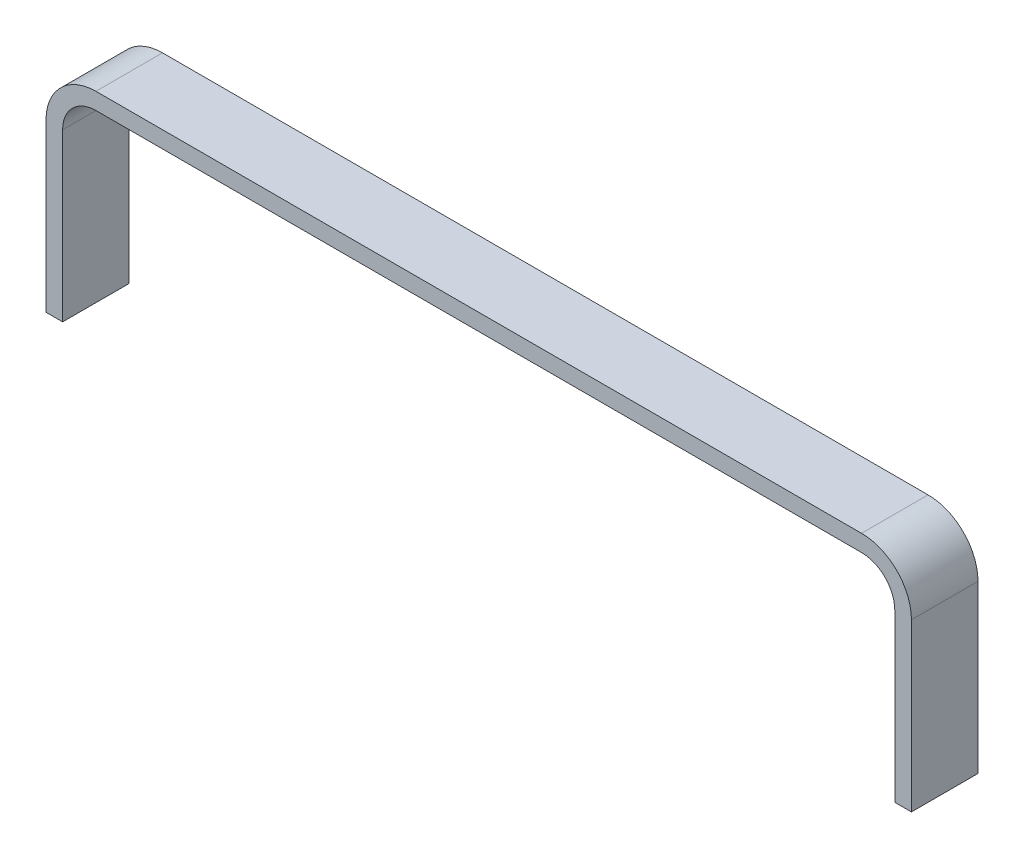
ISO-10303-21;
HEADER;
FILE_DESCRIPTION(('STEP AP214'),'2;1');
FILE_NAME('part.step','',(''),(''),'','','');
FILE_SCHEMA(('AUTOMOTIVE_DESIGN { 1 0 10303 214 1 1 1 1 }'));
ENDSEC;
DATA;
#1=APPLICATION_CONTEXT('core data for automotive mechanical design processes');
#2=APPLICATION_PROTOCOL_DEFINITION('international standard','automotive_design',2000,#1);
#3=PRODUCT_CONTEXT('',#1,'mechanical');
#4=PRODUCT('Part','Part','',(#3));
#5=PRODUCT_RELATED_PRODUCT_CATEGORY('part','',(#4));
#6=PRODUCT_DEFINITION_FORMATION('','',#4);
#7=PRODUCT_DEFINITION_CONTEXT('part definition',#1,'design');
#8=PRODUCT_DEFINITION('design','',#6,#7);
#9=PRODUCT_DEFINITION_SHAPE('','',#8);
#10=(LENGTH_UNIT() NAMED_UNIT(*) SI_UNIT(.MILLI.,.METRE.));
#11=(NAMED_UNIT(*) PLANE_ANGLE_UNIT() SI_UNIT($,.RADIAN.));
#12=(NAMED_UNIT(*) SI_UNIT($,.STERADIAN.) SOLID_ANGLE_UNIT());
#13=UNCERTAINTY_MEASURE_WITH_UNIT(LENGTH_MEASURE(1.E-05),#10,'distance_accuracy_value','');
#14=(GEOMETRIC_REPRESENTATION_CONTEXT(3) GLOBAL_UNCERTAINTY_ASSIGNED_CONTEXT((#13)) GLOBAL_UNIT_ASSIGNED_CONTEXT((#10,
#11,#12)) REPRESENTATION_CONTEXT('',''));
#15=CARTESIAN_POINT('',(0.,0.,0.));
#16=DIRECTION('',(0.,0.,1.));
#17=DIRECTION('',(1.,0.,0.));
#18=AXIS2_PLACEMENT_3D('',#15,#16,#17);
#19=CARTESIAN_POINT('',(0.,49.9999999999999,20.));
#20=DIRECTION('',(1.,0.,0.));
#21=DIRECTION('',(0.,1.,0.));
#22=AXIS2_PLACEMENT_3D('',#19,#20,#21);
#23=PLANE('',#22);
#24=DIRECTION('',(0.,-1.,0.));
#25=VECTOR('',#24,1.);
#26=CARTESIAN_POINT('',(0.,49.9999999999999,0.));
#27=LINE('',#26,#25);
#28=CARTESIAN_POINT('',(0.,49.9999999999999,0.));
#29=VERTEX_POINT('',#28);
#30=CARTESIAN_POINT('',(0.,0.,0.));
#31=VERTEX_POINT('',#30);
#32=EDGE_CURVE('E116',#29,#31,#27,.T.);
#33=ORIENTED_EDGE('',*,*,#32,.T.);
#34=DIRECTION('',(0.,0.,-1.));
#35=VECTOR('',#34,1.);
#36=CARTESIAN_POINT('',(0.,0.,20.));
#37=LINE('',#36,#35);
#38=CARTESIAN_POINT('',(0.,0.,20.));
#39=VERTEX_POINT('',#38);
#40=EDGE_CURVE('E11',#39,#31,#37,.T.);
#41=ORIENTED_EDGE('',*,*,#40,.F.);
#42=DIRECTION('',(0.,-1.,0.));
#43=VECTOR('',#42,1.);
#44=CARTESIAN_POINT('',(0.,49.9999999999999,20.));
#45=LINE('',#44,#43);
#46=CARTESIAN_POINT('',(0.,49.9999999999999,20.));
#47=VERTEX_POINT('',#46);
#48=EDGE_CURVE('E151',#47,#39,#45,.T.);
#49=ORIENTED_EDGE('',*,*,#48,.F.);
#50=DIRECTION('',(0.,0.,-1.));
#51=VECTOR('',#50,1.);
#52=CARTESIAN_POINT('',(0.,49.9999999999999,20.));
#53=LINE('',#52,#51);
#54=EDGE_CURVE('E129',#47,#29,#53,.T.);
#55=ORIENTED_EDGE('',*,*,#54,.T.);
#56=EDGE_LOOP('',(#33,#41,#49,#55));
#57=FACE_BOUND('',#56,.T.);
#58=ADVANCED_FACE('F24',(#57),#23,.F.);
#59=CARTESIAN_POINT('',(0.,0.,20.));
#60=DIRECTION('',(0.,1.,0.));
#61=DIRECTION('',(0.,0.,1.));
#62=AXIS2_PLACEMENT_3D('',#59,#60,#61);
#63=PLANE('',#62);
#64=DIRECTION('',(1.,0.,0.));
#65=VECTOR('',#64,1.);
#66=CARTESIAN_POINT('',(0.,0.,0.));
#67=LINE('',#66,#65);
#68=CARTESIAN_POINT('',(5.00000000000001,0.,0.));
#69=VERTEX_POINT('',#68);
#70=EDGE_CURVE('E112',#31,#69,#67,.T.);
#71=ORIENTED_EDGE('',*,*,#70,.T.);
#72=DIRECTION('',(0.,0.,-1.));
#73=VECTOR('',#72,1.);
#74=CARTESIAN_POINT('',(5.00000000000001,0.,20.));
#75=LINE('',#74,#73);
#76=CARTESIAN_POINT('',(5.00000000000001,0.,20.));
#77=VERTEX_POINT('',#76);
#78=EDGE_CURVE('E31',#77,#69,#75,.T.);
#79=ORIENTED_EDGE('',*,*,#78,.F.);
#80=DIRECTION('',(1.,0.,0.));
#81=VECTOR('',#80,1.);
#82=CARTESIAN_POINT('',(0.,0.,20.));
#83=LINE('',#82,#81);
#84=EDGE_CURVE('E125',#39,#77,#83,.T.);
#85=ORIENTED_EDGE('',*,*,#84,.F.);
#86=ORIENTED_EDGE('',*,*,#40,.T.);
#87=EDGE_LOOP('',(#71,#79,#85,#86));
#88=FACE_BOUND('',#87,.T.);
#89=ADVANCED_FACE('F124',(#88),#63,.F.);
#90=CARTESIAN_POINT('',(5.00000000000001,0.,20.));
#91=DIRECTION('',(-1.,0.,0.));
#92=DIRECTION('',(0.,0.,1.));
#93=AXIS2_PLACEMENT_3D('',#90,#91,#92);
#94=PLANE('',#93);
#95=DIRECTION('',(0.,1.,0.));
#96=VECTOR('',#95,1.);
#97=CARTESIAN_POINT('',(5.00000000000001,0.,0.));
#98=LINE('',#97,#96);
#99=CARTESIAN_POINT('',(5.00000000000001,49.9999999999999,0.));
#100=VERTEX_POINT('',#99);
#101=EDGE_CURVE('E118',#69,#100,#98,.T.);
#102=ORIENTED_EDGE('',*,*,#101,.T.);
#103=DIRECTION('',(0.,0.,-1.));
#104=VECTOR('',#103,1.);
#105=CARTESIAN_POINT('',(5.00000000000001,49.9999999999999,20.));
#106=LINE('',#105,#104);
#107=CARTESIAN_POINT('',(5.00000000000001,49.9999999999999,20.));
#108=VERTEX_POINT('',#107);
#109=EDGE_CURVE('E197',#108,#100,#106,.T.);
#110=ORIENTED_EDGE('',*,*,#109,.F.);
#111=DIRECTION('',(0.,1.,0.));
#112=VECTOR('',#111,1.);
#113=CARTESIAN_POINT('',(5.00000000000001,0.,20.));
#114=LINE('',#113,#112);
#115=EDGE_CURVE('E154',#77,#108,#114,.T.);
#116=ORIENTED_EDGE('',*,*,#115,.F.);
#117=ORIENTED_EDGE('',*,*,#78,.T.);
#118=EDGE_LOOP('',(#102,#110,#116,#117));
#119=FACE_BOUND('',#118,.T.);
#120=ADVANCED_FACE('F201',(#119),#94,.F.);
#121=CARTESIAN_POINT('',(15.,50.,20.));
#122=DIRECTION('',(0.,0.,-1.));
#123=DIRECTION('',(-1.,0.,0.));
#124=AXIS2_PLACEMENT_3D('',#121,#122,#123);
#125=CYLINDRICAL_SURFACE('',#124,10.);
#126=CARTESIAN_POINT('',(15.,50.,0.));
#127=DIRECTION('',(0.,0.,-1.));
#128=DIRECTION('',(1.,0.,0.));
#129=AXIS2_PLACEMENT_3D('',#126,#127,#128);
#130=CIRCLE('',#129,10.);
#131=CARTESIAN_POINT('',(15.0000000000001,60.,0.));
#132=VERTEX_POINT('',#131);
#133=EDGE_CURVE('E133',#100,#132,#130,.T.);
#134=ORIENTED_EDGE('',*,*,#133,.T.);
#135=DIRECTION('',(0.,0.,-1.));
#136=VECTOR('',#135,1.);
#137=CARTESIAN_POINT('',(15.0000000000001,60.,20.));
#138=LINE('',#137,#136);
#139=CARTESIAN_POINT('',(15.0000000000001,60.,20.));
#140=VERTEX_POINT('',#139);
#141=EDGE_CURVE('E194',#140,#132,#138,.T.);
#142=ORIENTED_EDGE('',*,*,#141,.F.);
#143=CARTESIAN_POINT('',(15.,50.,20.));
#144=DIRECTION('',(0.,0.,-1.));
#145=DIRECTION('',(1.,0.,0.));
#146=AXIS2_PLACEMENT_3D('',#143,#144,#145);
#147=CIRCLE('',#146,10.);
#148=EDGE_CURVE('E156',#108,#140,#147,.T.);
#149=ORIENTED_EDGE('',*,*,#148,.F.);
#150=ORIENTED_EDGE('',*,*,#109,.T.);
#151=EDGE_LOOP('',(#134,#142,#149,#150));
#152=FACE_BOUND('',#151,.T.);
#153=ADVANCED_FACE('F209',(#152),#125,.F.);
#154=CARTESIAN_POINT('',(15.0000000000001,60.,20.));
#155=DIRECTION('',(0.,1.,0.));
#156=DIRECTION('',(0.,0.,1.));
#157=AXIS2_PLACEMENT_3D('',#154,#155,#156);
#158=PLANE('',#157);
#159=DIRECTION('',(1.,0.,0.));
#160=VECTOR('',#159,1.);
#161=CARTESIAN_POINT('',(15.0000000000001,60.,0.));
#162=LINE('',#161,#160);
#163=CARTESIAN_POINT('',(245.,60.,0.));
#164=VERTEX_POINT('',#163);
#165=EDGE_CURVE('E135',#132,#164,#162,.T.);
#166=ORIENTED_EDGE('',*,*,#165,.T.);
#167=DIRECTION('',(0.,0.,-1.));
#168=VECTOR('',#167,1.);
#169=CARTESIAN_POINT('',(245.,60.,20.));
#170=LINE('',#169,#168);
#171=CARTESIAN_POINT('',(245.,60.,20.));
#172=VERTEX_POINT('',#171);
#173=EDGE_CURVE('E191',#172,#164,#170,.T.);
#174=ORIENTED_EDGE('',*,*,#173,.F.);
#175=DIRECTION('',(1.,0.,0.));
#176=VECTOR('',#175,1.);
#177=CARTESIAN_POINT('',(15.0000000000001,60.,20.));
#178=LINE('',#177,#176);
#179=EDGE_CURVE('E158',#140,#172,#178,.T.);
#180=ORIENTED_EDGE('',*,*,#179,.F.);
#181=ORIENTED_EDGE('',*,*,#141,.T.);
#182=EDGE_LOOP('',(#166,#174,#180,#181));
#183=FACE_BOUND('',#182,.T.);
#184=ADVANCED_FACE('F212',(#183),#158,.F.);
#185=CARTESIAN_POINT('',(245.,50.,20.));
#186=DIRECTION('',(0.,0.,-1.));
#187=DIRECTION('',(-1.,0.,0.));
#188=AXIS2_PLACEMENT_3D('',#185,#186,#187);
#189=CYLINDRICAL_SURFACE('',#188,10.);
#190=CARTESIAN_POINT('',(245.,50.,0.));
#191=DIRECTION('',(0.,0.,-1.));
#192=DIRECTION('',(1.,0.,0.));
#193=AXIS2_PLACEMENT_3D('',#190,#191,#192);
#194=CIRCLE('',#193,10.);
#195=CARTESIAN_POINT('',(255.,49.9999999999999,0.));
#196=VERTEX_POINT('',#195);
#197=EDGE_CURVE('E137',#164,#196,#194,.T.);
#198=ORIENTED_EDGE('',*,*,#197,.T.);
#199=DIRECTION('',(0.,0.,-1.));
#200=VECTOR('',#199,1.);
#201=CARTESIAN_POINT('',(255.,49.9999999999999,20.));
#202=LINE('',#201,#200);
#203=CARTESIAN_POINT('',(255.,49.9999999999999,20.));
#204=VERTEX_POINT('',#203);
#205=EDGE_CURVE('E188',#204,#196,#202,.T.);
#206=ORIENTED_EDGE('',*,*,#205,.F.);
#207=CARTESIAN_POINT('',(245.,50.,20.));
#208=DIRECTION('',(0.,0.,-1.));
#209=DIRECTION('',(1.,0.,0.));
#210=AXIS2_PLACEMENT_3D('',#207,#208,#209);
#211=CIRCLE('',#210,10.);
#212=EDGE_CURVE('E160',#172,#204,#211,.T.);
#213=ORIENTED_EDGE('',*,*,#212,.F.);
#214=ORIENTED_EDGE('',*,*,#173,.T.);
#215=EDGE_LOOP('',(#198,#206,#213,#214));
#216=FACE_BOUND('',#215,.T.);
#217=ADVANCED_FACE('F217',(#216),#189,.F.);
#218=CARTESIAN_POINT('',(255.,49.9999999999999,20.));
#219=DIRECTION('',(1.,0.,0.));
#220=DIRECTION('',(0.,0.,-1.));
#221=AXIS2_PLACEMENT_3D('',#218,#219,#220);
#222=PLANE('',#221);
#223=DIRECTION('',(0.,-1.,0.));
#224=VECTOR('',#223,1.);
#225=CARTESIAN_POINT('',(255.,49.9999999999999,0.));
#226=LINE('',#225,#224);
#227=CARTESIAN_POINT('',(255.,0.,0.));
#228=VERTEX_POINT('',#227);
#229=EDGE_CURVE('E139',#196,#228,#226,.T.);
#230=ORIENTED_EDGE('',*,*,#229,.T.);
#231=DIRECTION('',(0.,0.,-1.));
#232=VECTOR('',#231,1.);
#233=CARTESIAN_POINT('',(255.,0.,20.));
#234=LINE('',#233,#232);
#235=CARTESIAN_POINT('',(255.,0.,20.));
#236=VERTEX_POINT('',#235);
#237=EDGE_CURVE('E185',#236,#228,#234,.T.);
#238=ORIENTED_EDGE('',*,*,#237,.F.);
#239=DIRECTION('',(0.,-1.,0.));
#240=VECTOR('',#239,1.);
#241=CARTESIAN_POINT('',(255.,49.9999999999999,20.));
#242=LINE('',#241,#240);
#243=EDGE_CURVE('E162',#204,#236,#242,.T.);
#244=ORIENTED_EDGE('',*,*,#243,.F.);
#245=ORIENTED_EDGE('',*,*,#205,.T.);
#246=EDGE_LOOP('',(#230,#238,#244,#245));
#247=FACE_BOUND('',#246,.T.);
#248=ADVANCED_FACE('F223',(#247),#222,.F.);
#249=CARTESIAN_POINT('',(255.,0.,20.));
#250=DIRECTION('',(0.,1.,0.));
#251=DIRECTION('',(0.,0.,1.));
#252=AXIS2_PLACEMENT_3D('',#249,#250,#251);
#253=PLANE('',#252);
#254=DIRECTION('',(1.,0.,0.));
#255=VECTOR('',#254,1.);
#256=CARTESIAN_POINT('',(255.,0.,0.));
#257=LINE('',#256,#255);
#258=CARTESIAN_POINT('',(260.,0.,0.));
#259=VERTEX_POINT('',#258);
#260=EDGE_CURVE('E141',#228,#259,#257,.T.);
#261=ORIENTED_EDGE('',*,*,#260,.T.);
#262=DIRECTION('',(0.,0.,-1.));
#263=VECTOR('',#262,1.);
#264=CARTESIAN_POINT('',(260.,0.,20.));
#265=LINE('',#264,#263);
#266=CARTESIAN_POINT('',(260.,0.,20.));
#267=VERTEX_POINT('',#266);
#268=EDGE_CURVE('E182',#267,#259,#265,.T.);
#269=ORIENTED_EDGE('',*,*,#268,.F.);
#270=DIRECTION('',(1.,0.,0.));
#271=VECTOR('',#270,1.);
#272=CARTESIAN_POINT('',(255.,0.,20.));
#273=LINE('',#272,#271);
#274=EDGE_CURVE('E164',#236,#267,#273,.T.);
#275=ORIENTED_EDGE('',*,*,#274,.F.);
#276=ORIENTED_EDGE('',*,*,#237,.T.);
#277=EDGE_LOOP('',(#261,#269,#275,#276));
#278=FACE_BOUND('',#277,.T.);
#279=ADVANCED_FACE('F227',(#278),#253,.F.);
#280=CARTESIAN_POINT('',(260.,0.,20.));
#281=DIRECTION('',(-1.,0.,0.));
#282=DIRECTION('',(0.,0.,1.));
#283=AXIS2_PLACEMENT_3D('',#280,#281,#282);
#284=PLANE('',#283);
#285=DIRECTION('',(0.,1.,0.));
#286=VECTOR('',#285,1.);
#287=CARTESIAN_POINT('',(260.,0.,0.));
#288=LINE('',#287,#286);
#289=CARTESIAN_POINT('',(260.,49.9999999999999,0.));
#290=VERTEX_POINT('',#289);
#291=EDGE_CURVE('E143',#259,#290,#288,.T.);
#292=ORIENTED_EDGE('',*,*,#291,.T.);
#293=DIRECTION('',(0.,0.,-1.));
#294=VECTOR('',#293,1.);
#295=CARTESIAN_POINT('',(260.,49.9999999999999,20.));
#296=LINE('',#295,#294);
#297=CARTESIAN_POINT('',(260.,49.9999999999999,20.));
#298=VERTEX_POINT('',#297);
#299=EDGE_CURVE('E179',#298,#290,#296,.T.);
#300=ORIENTED_EDGE('',*,*,#299,.F.);
#301=DIRECTION('',(0.,1.,0.));
#302=VECTOR('',#301,1.);
#303=CARTESIAN_POINT('',(260.,0.,20.));
#304=LINE('',#303,#302);
#305=EDGE_CURVE('E166',#267,#298,#304,.T.);
#306=ORIENTED_EDGE('',*,*,#305,.F.);
#307=ORIENTED_EDGE('',*,*,#268,.T.);
#308=EDGE_LOOP('',(#292,#300,#306,#307));
#309=FACE_BOUND('',#308,.T.);
#310=ADVANCED_FACE('F232',(#309),#284,.F.);
#311=CARTESIAN_POINT('',(245.,50.,20.));
#312=DIRECTION('',(0.,0.,-1.));
#313=DIRECTION('',(-1.,0.,0.));
#314=AXIS2_PLACEMENT_3D('',#311,#312,#313);
#315=CYLINDRICAL_SURFACE('',#314,15.);
#316=CARTESIAN_POINT('',(245.,50.,0.));
#317=DIRECTION('',(0.,0.,1.));
#318=DIRECTION('',(1.,0.,0.));
#319=AXIS2_PLACEMENT_3D('',#316,#317,#318);
#320=CIRCLE('',#319,15.);
#321=CARTESIAN_POINT('',(245.,65.,0.));
#322=VERTEX_POINT('',#321);
#323=EDGE_CURVE('E145',#290,#322,#320,.T.);
#324=ORIENTED_EDGE('',*,*,#323,.T.);
#325=DIRECTION('',(0.,0.,-1.));
#326=VECTOR('',#325,1.);
#327=CARTESIAN_POINT('',(245.,65.,20.));
#328=LINE('',#327,#326);
#329=CARTESIAN_POINT('',(245.,65.,20.));
#330=VERTEX_POINT('',#329);
#331=EDGE_CURVE('E176',#330,#322,#328,.T.);
#332=ORIENTED_EDGE('',*,*,#331,.F.);
#333=CARTESIAN_POINT('',(245.,50.,20.));
#334=DIRECTION('',(0.,0.,1.));
#335=DIRECTION('',(1.,0.,0.));
#336=AXIS2_PLACEMENT_3D('',#333,#334,#335);
#337=CIRCLE('',#336,15.);
#338=EDGE_CURVE('E168',#298,#330,#337,.T.);
#339=ORIENTED_EDGE('',*,*,#338,.F.);
#340=ORIENTED_EDGE('',*,*,#299,.T.);
#341=EDGE_LOOP('',(#324,#332,#339,#340));
#342=FACE_BOUND('',#341,.T.);
#343=ADVANCED_FACE('F236',(#342),#315,.T.);
#344=CARTESIAN_POINT('',(245.,65.,20.));
#345=DIRECTION('',(0.,-1.,0.));
#346=DIRECTION('',(1.,0.,0.));
#347=AXIS2_PLACEMENT_3D('',#344,#345,#346);
#348=PLANE('',#347);
#349=DIRECTION('',(-1.,0.,0.));
#350=VECTOR('',#349,1.);
#351=CARTESIAN_POINT('',(245.,65.,0.));
#352=LINE('',#351,#350);
#353=CARTESIAN_POINT('',(15.0000000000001,65.,0.));
#354=VERTEX_POINT('',#353);
#355=EDGE_CURVE('E147',#322,#354,#352,.T.);
#356=ORIENTED_EDGE('',*,*,#355,.T.);
#357=DIRECTION('',(0.,0.,-1.));
#358=VECTOR('',#357,1.);
#359=CARTESIAN_POINT('',(15.0000000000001,65.,20.));
#360=LINE('',#359,#358);
#361=CARTESIAN_POINT('',(15.0000000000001,65.,20.));
#362=VERTEX_POINT('',#361);
#363=EDGE_CURVE('E173',#362,#354,#360,.T.);
#364=ORIENTED_EDGE('',*,*,#363,.F.);
#365=DIRECTION('',(-1.,0.,0.));
#366=VECTOR('',#365,1.);
#367=CARTESIAN_POINT('',(245.,65.,20.));
#368=LINE('',#367,#366);
#369=EDGE_CURVE('E43',#330,#362,#368,.T.);
#370=ORIENTED_EDGE('',*,*,#369,.F.);
#371=ORIENTED_EDGE('',*,*,#331,.T.);
#372=EDGE_LOOP('',(#356,#364,#370,#371));
#373=FACE_BOUND('',#372,.T.);
#374=ADVANCED_FACE('F240',(#373),#348,.F.);
#375=CARTESIAN_POINT('',(15.,50.,20.));
#376=DIRECTION('',(0.,0.,-1.));
#377=DIRECTION('',(-1.,0.,0.));
#378=AXIS2_PLACEMENT_3D('',#375,#376,#377);
#379=CYLINDRICAL_SURFACE('',#378,15.);
#380=CARTESIAN_POINT('',(15.,50.,0.));
#381=DIRECTION('',(0.,0.,1.));
#382=DIRECTION('',(1.,0.,0.));
#383=AXIS2_PLACEMENT_3D('',#380,#381,#382);
#384=CIRCLE('',#383,15.);
#385=EDGE_CURVE('E149',#354,#29,#384,.T.);
#386=ORIENTED_EDGE('',*,*,#385,.T.);
#387=ORIENTED_EDGE('',*,*,#54,.F.);
#388=CARTESIAN_POINT('',(15.,50.,20.));
#389=DIRECTION('',(0.,0.,1.));
#390=DIRECTION('',(1.,0.,0.));
#391=AXIS2_PLACEMENT_3D('',#388,#389,#390);
#392=CIRCLE('',#391,15.);
#393=EDGE_CURVE('E38',#362,#47,#392,.T.);
#394=ORIENTED_EDGE('',*,*,#393,.F.);
#395=ORIENTED_EDGE('',*,*,#363,.T.);
#396=EDGE_LOOP('',(#386,#387,#394,#395));
#397=FACE_BOUND('',#396,.T.);
#398=ADVANCED_FACE('F242',(#397),#379,.T.);
#399=CARTESIAN_POINT('',(15.,50.,20.));
#400=DIRECTION('',(0.,0.,1.));
#401=DIRECTION('',(1.,0.,0.));
#402=AXIS2_PLACEMENT_3D('',#399,#400,#401);
#403=PLANE('',#402);
#404=ORIENTED_EDGE('',*,*,#48,.T.);
#405=ORIENTED_EDGE('',*,*,#84,.T.);
#406=ORIENTED_EDGE('',*,*,#115,.T.);
#407=ORIENTED_EDGE('',*,*,#148,.T.);
#408=ORIENTED_EDGE('',*,*,#179,.T.);
#409=ORIENTED_EDGE('',*,*,#212,.T.);
#410=ORIENTED_EDGE('',*,*,#243,.T.);
#411=ORIENTED_EDGE('',*,*,#274,.T.);
#412=ORIENTED_EDGE('',*,*,#305,.T.);
#413=ORIENTED_EDGE('',*,*,#338,.T.);
#414=ORIENTED_EDGE('',*,*,#369,.T.);
#415=ORIENTED_EDGE('',*,*,#393,.T.);
#416=EDGE_LOOP('',(#404,#405,#406,#407,#408,#409,#410,#411,#412,#413,#414,#415));
#417=FACE_BOUND('',#416,.T.);
#418=ADVANCED_FACE('F204',(#417),#403,.T.);
#419=CARTESIAN_POINT('',(15.,50.,0.));
#420=DIRECTION('',(0.,0.,1.));
#421=DIRECTION('',(1.,0.,0.));
#422=AXIS2_PLACEMENT_3D('',#419,#420,#421);
#423=PLANE('',#422);
#424=ORIENTED_EDGE('',*,*,#32,.F.);
#425=ORIENTED_EDGE('',*,*,#385,.F.);
#426=ORIENTED_EDGE('',*,*,#355,.F.);
#427=ORIENTED_EDGE('',*,*,#323,.F.);
#428=ORIENTED_EDGE('',*,*,#291,.F.);
#429=ORIENTED_EDGE('',*,*,#260,.F.);
#430=ORIENTED_EDGE('',*,*,#229,.F.);
#431=ORIENTED_EDGE('',*,*,#197,.F.);
#432=ORIENTED_EDGE('',*,*,#165,.F.);
#433=ORIENTED_EDGE('',*,*,#133,.F.);
#434=ORIENTED_EDGE('',*,*,#101,.F.);
#435=ORIENTED_EDGE('',*,*,#70,.F.);
#436=EDGE_LOOP('',(#424,#425,#426,#427,#428,#429,#430,#431,#432,#433,#434,#435));
#437=FACE_BOUND('',#436,.T.);
#438=ADVANCED_FACE('F113',(#437),#423,.F.);
#439=CLOSED_SHELL('',(#58,#89,#120,#153,#184,#217,#248,#279,#310,#343,#374,#398,#418,#438));
#440=MANIFOLD_SOLID_BREP('B2',#439);
#441=ADVANCED_BREP_SHAPE_REPRESENTATION('',(#18,#440),#14);
#442=SHAPE_DEFINITION_REPRESENTATION(#9,#441);
ENDSEC;
END-ISO-10303-21;
